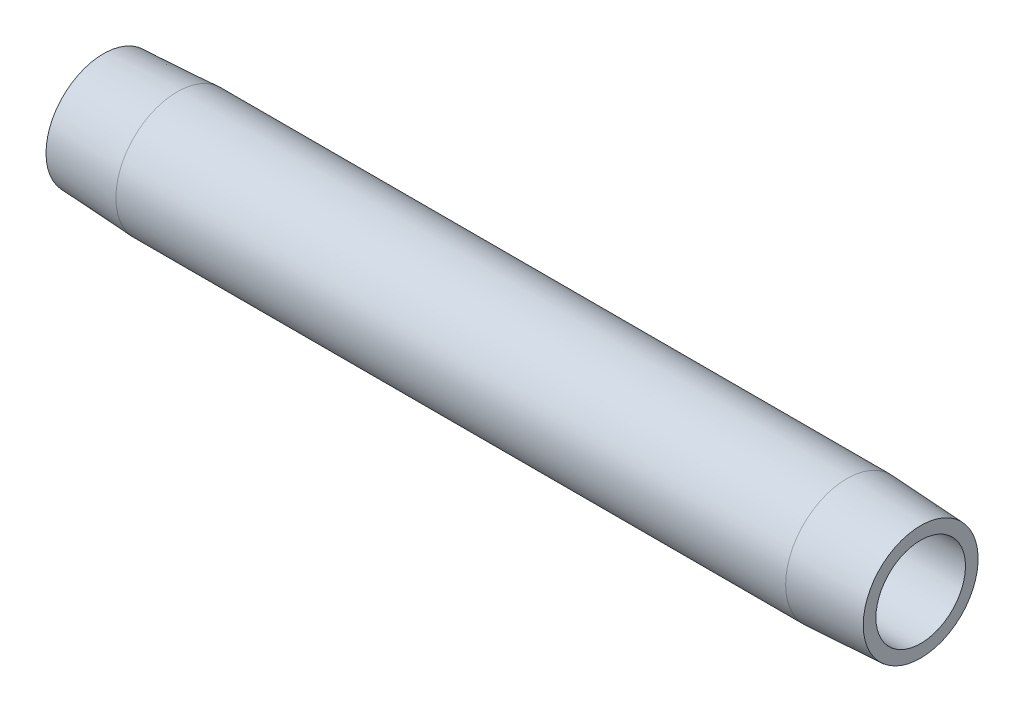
ISO-10303-21;
HEADER;
FILE_DESCRIPTION(('STEP AP214'),'2;1');
FILE_NAME('part.step','',(''),(''),'','','');
FILE_SCHEMA(('AUTOMOTIVE_DESIGN { 1 0 10303 214 1 1 1 1 }'));
ENDSEC;
DATA;
#1=APPLICATION_CONTEXT('core data for automotive mechanical design processes');
#2=APPLICATION_PROTOCOL_DEFINITION('international standard','automotive_design',2000,#1);
#3=PRODUCT_CONTEXT('',#1,'mechanical');
#4=PRODUCT('Part','Part','',(#3));
#5=PRODUCT_RELATED_PRODUCT_CATEGORY('part','',(#4));
#6=PRODUCT_DEFINITION_FORMATION('','',#4);
#7=PRODUCT_DEFINITION_CONTEXT('part definition',#1,'design');
#8=PRODUCT_DEFINITION('design','',#6,#7);
#9=PRODUCT_DEFINITION_SHAPE('','',#8);
#10=(LENGTH_UNIT() NAMED_UNIT(*) SI_UNIT(.MILLI.,.METRE.));
#11=(NAMED_UNIT(*) PLANE_ANGLE_UNIT() SI_UNIT($,.RADIAN.));
#12=(NAMED_UNIT(*) SI_UNIT($,.STERADIAN.) SOLID_ANGLE_UNIT());
#13=UNCERTAINTY_MEASURE_WITH_UNIT(LENGTH_MEASURE(1.E-05),#10,'distance_accuracy_value','');
#14=(GEOMETRIC_REPRESENTATION_CONTEXT(3) GLOBAL_UNCERTAINTY_ASSIGNED_CONTEXT((#13)) GLOBAL_UNIT_ASSIGNED_CONTEXT((#10,
#11,#12)) REPRESENTATION_CONTEXT('',''));
#15=CARTESIAN_POINT('',(0.,0.,0.));
#16=DIRECTION('',(0.,0.,1.));
#17=DIRECTION('',(1.,0.,0.));
#18=AXIS2_PLACEMENT_3D('',#15,#16,#17);
#19=CARTESIAN_POINT('',(114.3,6.26110000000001,0.));
#20=DIRECTION('',(-1.,0.,0.));
#21=DIRECTION('',(0.,0.,1.));
#22=AXIS2_PLACEMENT_3D('',#19,#20,#21);
#23=PLANE('',#22);
#24=CARTESIAN_POINT('',(114.3,0.,0.));
#25=DIRECTION('',(-1.,0.,0.));
#26=DIRECTION('',(0.,0.,1.));
#27=AXIS2_PLACEMENT_3D('',#24,#25,#26);
#28=CIRCLE('',#27,8.03205001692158);
#29=CARTESIAN_POINT('',(114.3,0.,8.03205001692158));
#30=VERTEX_POINT('',#29);
#31=EDGE_CURVE('E10',#30,#30,#28,.T.);
#32=ORIENTED_EDGE('',*,*,#31,.F.);
#33=EDGE_LOOP('',(#32));
#34=FACE_BOUND('',#33,.T.);
#35=CARTESIAN_POINT('',(114.3,0.,0.));
#36=DIRECTION('',(-1.,0.,0.));
#37=DIRECTION('',(0.,0.,1.));
#38=AXIS2_PLACEMENT_3D('',#35,#36,#37);
#39=CIRCLE('',#38,6.26110000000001);
#40=CARTESIAN_POINT('',(114.3,0.,6.26110000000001));
#41=VERTEX_POINT('',#40);
#42=EDGE_CURVE('E52',#41,#41,#39,.T.);
#43=ORIENTED_EDGE('',*,*,#42,.T.);
#44=EDGE_LOOP('',(#43));
#45=FACE_BOUND('',#44,.T.);
#46=ADVANCED_FACE('F30',(#34,#45),#23,.F.);
#47=CARTESIAN_POINT('',(114.3,0.,0.));
#48=DIRECTION('',(-1.,0.,0.));
#49=DIRECTION('',(0.,0.,1.));
#50=AXIS2_PLACEMENT_3D('',#47,#48,#49);
#51=CONICAL_SURFACE('',#50,8.03205001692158,0.0523598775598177);
#52=CARTESIAN_POINT('',(103.9876,0.,0.));
#53=DIRECTION('',(-1.,0.,0.));
#54=DIRECTION('',(0.,0.,1.));
#55=AXIS2_PLACEMENT_3D('',#52,#53,#54);
#56=CIRCLE('',#55,8.57249999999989);
#57=CARTESIAN_POINT('',(103.9876,0.,8.57249999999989));
#58=VERTEX_POINT('',#57);
#59=EDGE_CURVE('E36',#58,#58,#56,.T.);
#60=ORIENTED_EDGE('',*,*,#59,.F.);
#61=EDGE_LOOP('',(#60));
#62=FACE_BOUND('',#61,.T.);
#63=ORIENTED_EDGE('',*,*,#31,.T.);
#64=EDGE_LOOP('',(#63));
#65=FACE_BOUND('',#64,.T.);
#66=ADVANCED_FACE('F77',(#62,#65),#51,.T.);
#67=CARTESIAN_POINT('',(0.,0.,0.));
#68=DIRECTION('',(-1.,0.,0.));
#69=DIRECTION('',(0.,0.,1.));
#70=AXIS2_PLACEMENT_3D('',#67,#68,#69);
#71=CYLINDRICAL_SURFACE('',#70,8.57249999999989);
#72=CARTESIAN_POINT('',(10.3124,0.,0.));
#73=DIRECTION('',(-1.,0.,0.));
#74=DIRECTION('',(0.,0.,1.));
#75=AXIS2_PLACEMENT_3D('',#72,#73,#74);
#76=CIRCLE('',#75,8.57249999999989);
#77=CARTESIAN_POINT('',(10.3124,0.,8.57249999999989));
#78=VERTEX_POINT('',#77);
#79=EDGE_CURVE('E40',#78,#78,#76,.T.);
#80=ORIENTED_EDGE('',*,*,#79,.F.);
#81=EDGE_LOOP('',(#80));
#82=FACE_BOUND('',#81,.T.);
#83=ORIENTED_EDGE('',*,*,#59,.T.);
#84=EDGE_LOOP('',(#83));
#85=FACE_BOUND('',#84,.T.);
#86=ADVANCED_FACE('F72',(#82,#85),#71,.T.);
#87=CARTESIAN_POINT('',(10.3124,0.,0.));
#88=DIRECTION('',(1.,0.,0.));
#89=DIRECTION('',(0.,0.,-1.));
#90=AXIS2_PLACEMENT_3D('',#87,#88,#89);
#91=CONICAL_SURFACE('',#90,8.57249999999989,0.0523598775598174);
#92=CARTESIAN_POINT('',(0.,0.,0.));
#93=DIRECTION('',(-1.,0.,0.));
#94=DIRECTION('',(0.,0.,1.));
#95=AXIS2_PLACEMENT_3D('',#92,#93,#94);
#96=CIRCLE('',#95,8.03205001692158);
#97=CARTESIAN_POINT('',(0.,0.,8.03205001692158));
#98=VERTEX_POINT('',#97);
#99=EDGE_CURVE('E44',#98,#98,#96,.T.);
#100=ORIENTED_EDGE('',*,*,#99,.F.);
#101=EDGE_LOOP('',(#100));
#102=FACE_BOUND('',#101,.T.);
#103=ORIENTED_EDGE('',*,*,#79,.T.);
#104=EDGE_LOOP('',(#103));
#105=FACE_BOUND('',#104,.T.);
#106=ADVANCED_FACE('F66',(#102,#105),#91,.T.);
#107=CARTESIAN_POINT('',(0.,6.26110000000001,0.));
#108=DIRECTION('',(1.,0.,0.));
#109=DIRECTION('',(0.,0.,-1.));
#110=AXIS2_PLACEMENT_3D('',#107,#108,#109);
#111=PLANE('',#110);
#112=CARTESIAN_POINT('',(0.,0.,0.));
#113=DIRECTION('',(-1.,0.,0.));
#114=DIRECTION('',(0.,0.,1.));
#115=AXIS2_PLACEMENT_3D('',#112,#113,#114);
#116=CIRCLE('',#115,6.26110000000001);
#117=CARTESIAN_POINT('',(0.,0.,6.26110000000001));
#118=VERTEX_POINT('',#117);
#119=EDGE_CURVE('E49',#118,#118,#116,.T.);
#120=ORIENTED_EDGE('',*,*,#119,.F.);
#121=EDGE_LOOP('',(#120));
#122=FACE_BOUND('',#121,.T.);
#123=ORIENTED_EDGE('',*,*,#99,.T.);
#124=EDGE_LOOP('',(#123));
#125=FACE_BOUND('',#124,.T.);
#126=ADVANCED_FACE('F60',(#122,#125),#111,.F.);
#127=CARTESIAN_POINT('',(0.,0.,0.));
#128=DIRECTION('',(-1.,0.,0.));
#129=DIRECTION('',(0.,0.,1.));
#130=AXIS2_PLACEMENT_3D('',#127,#128,#129);
#131=CYLINDRICAL_SURFACE('',#130,6.26110000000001);
#132=ORIENTED_EDGE('',*,*,#42,.F.);
#133=EDGE_LOOP('',(#132));
#134=FACE_BOUND('',#133,.T.);
#135=ORIENTED_EDGE('',*,*,#119,.T.);
#136=EDGE_LOOP('',(#135));
#137=FACE_BOUND('',#136,.T.);
#138=ADVANCED_FACE('F57',(#134,#137),#131,.F.);
#139=CLOSED_SHELL('',(#46,#66,#86,#106,#126,#138));
#140=MANIFOLD_SOLID_BREP('B2',#139);
#141=ADVANCED_BREP_SHAPE_REPRESENTATION('',(#18,#140),#14);
#142=SHAPE_DEFINITION_REPRESENTATION(#9,#141);
ENDSEC;
END-ISO-10303-21;
